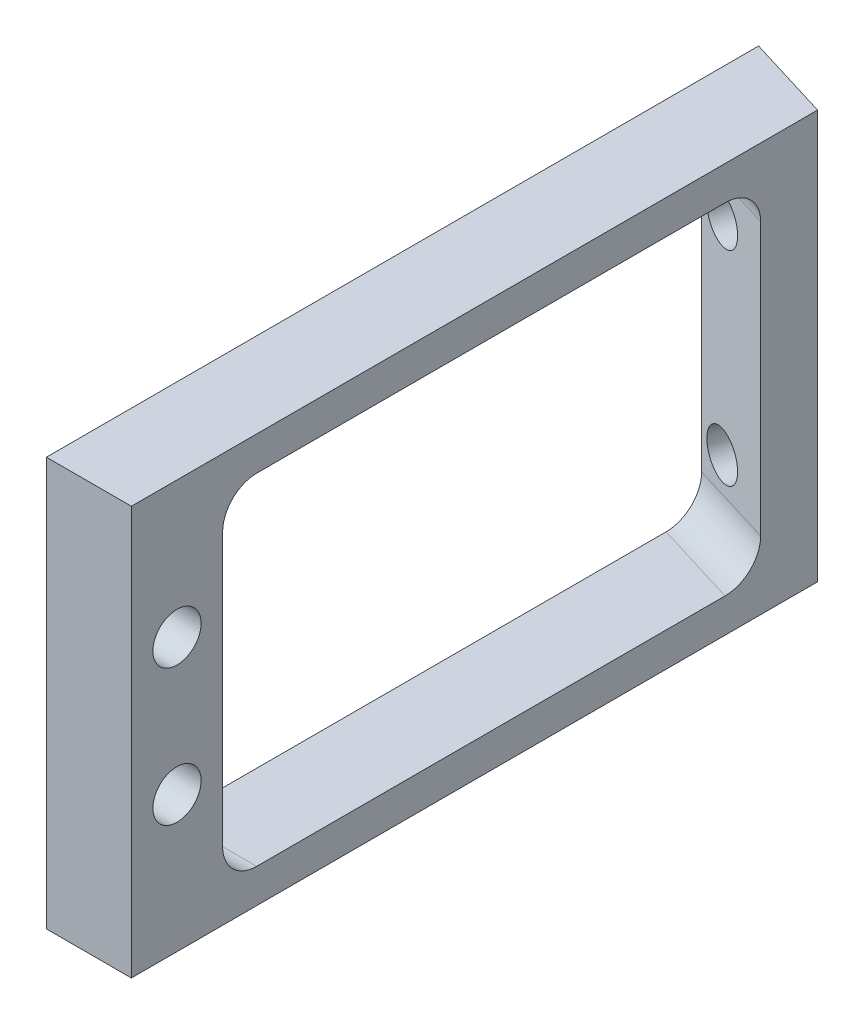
from build123d import *

# Parameters (mm, degrees)
SKETCH1_W             = 66.421
SKETCH1_H             = 38.1
EXTRUDE1_DEPTH        = 7.9248
CUT_EXTRUDE2_DEPTH    = 77.981567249
SKETCH4_R             = 2.159
CUT_EXTRUDE3_DEPTH    = 70.551809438
CUT_EXTRUDE4_DEPTH    = 70.551809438
CUT_EXTRUDE7_DEPTH    = 70.551809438
F_8_CLEARANCE_HOLE1_D = 4.4958


with BuildPart() as part:
    # Sketch1 → Extrude1 (new body)
    with BuildSketch(Plane(origin=(0, 0, 0), x_dir=(0, 0, -1), z_dir=(1, 0, 0))):
        with Locations((-33.2105, 0)):
            Rectangle(SKETCH1_W, SKETCH1_H)
    extrude(amount=EXTRUDE1_DEPTH)

    # Sketch3 → Cut-Extrude2 (cut, through all)
    with BuildSketch(Plane(origin=(0, 19.05, 0), x_dir=(-1, 0, 0), z_dir=(0, 1, 0))):
        Polygon((0, 0), (-7.9248, 2.422854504), (-7.9248, 0), align=None)
    extrude(amount=-CUT_EXTRUDE2_DEPTH, mode=Mode.SUBTRACT)

    # Sketch4 → Cut-Extrude3 (cut, through all)
    with BuildSketch(Plane(origin=(0, 0, 0), x_dir=(-0.9563047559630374, 0, -0.2923717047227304), z_dir=(0.2923717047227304, 0, -0.9563047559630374))):
        with Locations((-4.445, 9.525)):
            Circle(SKETCH4_R)
        with Locations((-4.445, -9.525)):
            Circle(SKETCH4_R)
    extrude(amount=-CUT_EXTRUDE3_DEPTH, mode=Mode.SUBTRACT)

    # Sketch5 → Cut-Extrude4 (cut, through all)
    with BuildSketch(Plane.ZY):
        with BuildLine():
            Line((11.303, 15.875), (54.737, 15.875))
            ThreePointArc((54.737, 15.875), (56.98206403, 14.94506403), (57.912, 12.7))
            Line((57.912, 12.7), (57.912, -12.7))
            ThreePointArc((57.912, -12.7), (56.98206403, -14.94506403), (54.737, -15.875))
            Line((54.737, -15.875), (11.303, -15.875))
            ThreePointArc((11.303, -15.875), (9.05793597, -14.94506403), (8.128, -12.7))
            Line((8.128, -12.7), (8.128, 12.7))
            ThreePointArc((8.128, 12.7), (9.05793597, 14.94506403), (11.303, 15.875))
        make_face()
    extrude(amount=-CUT_EXTRUDE4_DEPTH, mode=Mode.SUBTRACT)

    # Sketch6 → Cut-Extrude7 (cut, through all)
    with BuildSketch(Plane(origin=(0, 0, 0), x_dir=(0.2923717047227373, 0, -0.9563047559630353), z_dir=(0.9563047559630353, 0, 0.2923717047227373))):
        with BuildLine():
            Line((-14.605, -15.875), (-8.255, -15.875))
            ThreePointArc((-8.255, -15.875), (-6.00993597, -14.94506403), (-5.08, -12.7))
            Line((-5.08, -12.7), (-5.08, 12.7))
            ThreePointArc((-5.08, 12.7), (-6.00993597, 14.94506403), (-8.255, 15.875))
            Line((-8.255, 15.875), (-14.605, 15.875))
            ThreePointArc((-14.605, 15.875), (-16.85006403, 14.94506403), (-17.78, 12.7))
            Line((-17.78, 12.7), (-17.78, -12.7))
            ThreePointArc((-17.78, -12.7), (-16.85006403, -14.94506403), (-14.605, -15.875))
        make_face()
    extrude(amount=CUT_EXTRUDE7_DEPTH, mode=Mode.SUBTRACT)

    # 8 Clearance Hole1 (through all)
    with Locations(Plane(origin=(0, 6.35, 62.1665), x_dir=(0, 0, -1), z_dir=(-1, 0, 0))):
        with Locations((0, 0), (0, 12.7)):
            Hole(F_8_CLEARANCE_HOLE1_D / 2)


solid = part.part
